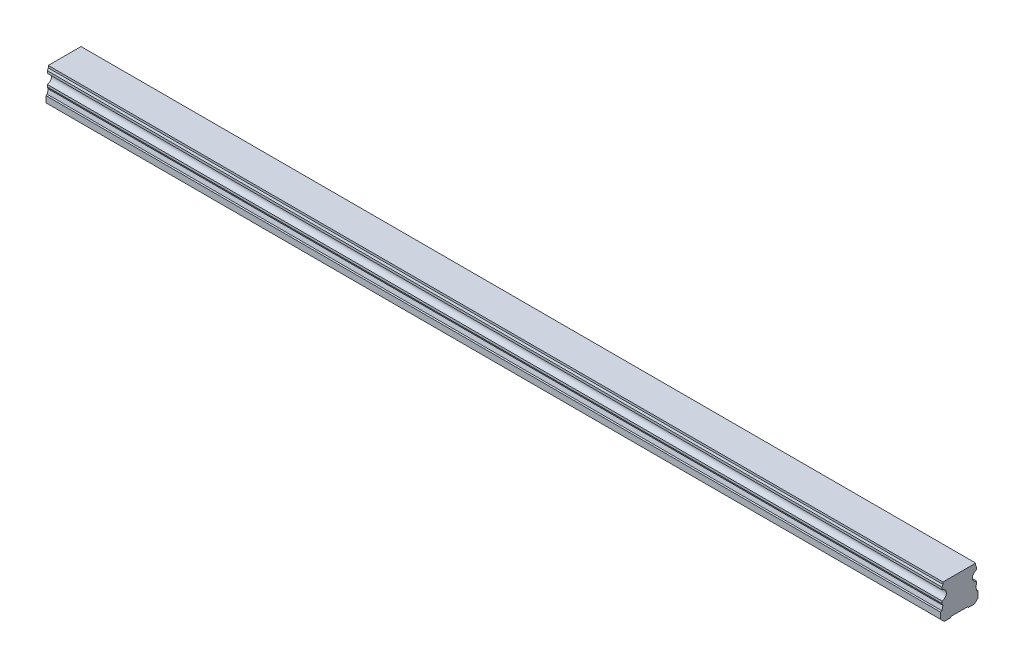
ISO-10303-21;
HEADER;
FILE_DESCRIPTION(('STEP AP214'),'2;1');
FILE_NAME('part.step','',(''),(''),'','','');
FILE_SCHEMA(('AUTOMOTIVE_DESIGN { 1 0 10303 214 1 1 1 1 }'));
ENDSEC;
DATA;
#1=APPLICATION_CONTEXT('core data for automotive mechanical design processes');
#2=APPLICATION_PROTOCOL_DEFINITION('international standard','automotive_design',2000,#1);
#3=PRODUCT_CONTEXT('',#1,'mechanical');
#4=PRODUCT('Part','Part','',(#3));
#5=PRODUCT_RELATED_PRODUCT_CATEGORY('part','',(#4));
#6=PRODUCT_DEFINITION_FORMATION('','',#4);
#7=PRODUCT_DEFINITION_CONTEXT('part definition',#1,'design');
#8=PRODUCT_DEFINITION('design','',#6,#7);
#9=PRODUCT_DEFINITION_SHAPE('','',#8);
#10=(LENGTH_UNIT() NAMED_UNIT(*) SI_UNIT(.MILLI.,.METRE.));
#11=(NAMED_UNIT(*) PLANE_ANGLE_UNIT() SI_UNIT($,.RADIAN.));
#12=(NAMED_UNIT(*) SI_UNIT($,.STERADIAN.) SOLID_ANGLE_UNIT());
#13=UNCERTAINTY_MEASURE_WITH_UNIT(LENGTH_MEASURE(1.E-05),#10,'distance_accuracy_value','');
#14=(GEOMETRIC_REPRESENTATION_CONTEXT(3) GLOBAL_UNCERTAINTY_ASSIGNED_CONTEXT((#13)) GLOBAL_UNIT_ASSIGNED_CONTEXT((#10,
#11,#12)) REPRESENTATION_CONTEXT('',''));
#15=CARTESIAN_POINT('',(0.,0.,0.));
#16=DIRECTION('',(0.,0.,1.));
#17=DIRECTION('',(1.,0.,0.));
#18=AXIS2_PLACEMENT_3D('',#15,#16,#17);
#19=CARTESIAN_POINT('',(330.,0.399999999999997,0.));
#20=DIRECTION('',(0.,-1.,0.));
#21=DIRECTION('',(0.,0.,-1.));
#22=AXIS2_PLACEMENT_3D('',#19,#20,#21);
#23=CONICAL_SURFACE('',#22,2.90000000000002,0.785398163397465);
#24=CARTESIAN_POINT('',(330.,0.799999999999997,0.));
#25=DIRECTION('',(0.,1.,0.));
#26=DIRECTION('',(0.,0.,1.));
#27=AXIS2_PLACEMENT_3D('',#24,#25,#26);
#28=CIRCLE('',#27,2.5);
#29=CARTESIAN_POINT('',(330.,0.799999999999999,2.5));
#30=VERTEX_POINT('',#29);
#31=EDGE_CURVE('E11',#30,#30,#28,.F.);
#32=ORIENTED_EDGE('',*,*,#31,.F.);
#33=EDGE_LOOP('',(#32));
#34=FACE_BOUND('',#33,.T.);
#35=CARTESIAN_POINT('',(330.,0.399999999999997,0.));
#36=DIRECTION('',(0.,1.,0.));
#37=DIRECTION('',(0.,0.,1.));
#38=AXIS2_PLACEMENT_3D('',#35,#36,#37);
#39=CIRCLE('',#38,2.90000000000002);
#40=CARTESIAN_POINT('',(330.,0.399999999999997,2.90000000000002));
#41=VERTEX_POINT('',#40);
#42=EDGE_CURVE('E468',#41,#41,#39,.T.);
#43=ORIENTED_EDGE('',*,*,#42,.F.);
#44=EDGE_LOOP('',(#43));
#45=FACE_BOUND('',#44,.T.);
#46=ADVANCED_FACE('F39',(#34,#45),#23,.F.);
#47=CARTESIAN_POINT('',(330.,7.,0.));
#48=DIRECTION('',(0.,-1.,0.));
#49=DIRECTION('',(0.,0.,-1.));
#50=AXIS2_PLACEMENT_3D('',#47,#48,#49);
#51=CYLINDRICAL_SURFACE('',#50,2.5);
#52=ORIENTED_EDGE('',*,*,#31,.T.);
#53=EDGE_LOOP('',(#52));
#54=FACE_BOUND('',#53,.T.);
#55=CARTESIAN_POINT('',(330.,7.,0.));
#56=DIRECTION('',(0.,-1.,0.));
#57=DIRECTION('',(0.,0.,-1.));
#58=AXIS2_PLACEMENT_3D('',#55,#56,#57);
#59=CIRCLE('',#58,2.5);
#60=CARTESIAN_POINT('',(330.,7.,-2.50000000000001));
#61=VERTEX_POINT('',#60);
#62=EDGE_CURVE('E49',#61,#61,#59,.T.);
#63=ORIENTED_EDGE('',*,*,#62,.F.);
#64=EDGE_LOOP('',(#63));
#65=FACE_BOUND('',#64,.T.);
#66=ADVANCED_FACE('F626',(#54,#65),#51,.F.);
#67=CARTESIAN_POINT('',(330.,7.,0.));
#68=DIRECTION('',(0.,-1.,0.));
#69=DIRECTION('',(0.,0.,-1.));
#70=AXIS2_PLACEMENT_3D('',#67,#68,#69);
#71=PLANE('',#70);
#72=CARTESIAN_POINT('',(330.,7.,0.));
#73=DIRECTION('',(0.,-1.,0.));
#74=DIRECTION('',(0.,0.,-1.));
#75=AXIS2_PLACEMENT_3D('',#72,#73,#74);
#76=CIRCLE('',#75,2.1);
#77=CARTESIAN_POINT('',(330.,7.,-2.1));
#78=VERTEX_POINT('',#77);
#79=EDGE_CURVE('E42',#78,#78,#76,.T.);
#80=ORIENTED_EDGE('',*,*,#79,.F.);
#81=EDGE_LOOP('',(#80));
#82=FACE_BOUND('',#81,.T.);
#83=ORIENTED_EDGE('',*,*,#62,.T.);
#84=EDGE_LOOP('',(#83));
#85=FACE_BOUND('',#84,.T.);
#86=ADVANCED_FACE('F631',(#82,#85),#71,.T.);
#87=CARTESIAN_POINT('',(270.,0.399999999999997,0.));
#88=DIRECTION('',(0.,-1.,0.));
#89=DIRECTION('',(0.,0.,-1.));
#90=AXIS2_PLACEMENT_3D('',#87,#88,#89);
#91=CONICAL_SURFACE('',#90,2.90000000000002,0.785398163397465);
#92=CARTESIAN_POINT('',(270.,0.799999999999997,0.));
#93=DIRECTION('',(0.,1.,0.));
#94=DIRECTION('',(0.,0.,1.));
#95=AXIS2_PLACEMENT_3D('',#92,#93,#94);
#96=CIRCLE('',#95,2.5);
#97=CARTESIAN_POINT('',(270.,0.799999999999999,2.5));
#98=VERTEX_POINT('',#97);
#99=EDGE_CURVE('E464',#98,#98,#96,.F.);
#100=ORIENTED_EDGE('',*,*,#99,.F.);
#101=EDGE_LOOP('',(#100));
#102=FACE_BOUND('',#101,.T.);
#103=CARTESIAN_POINT('',(270.,0.399999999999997,0.));
#104=DIRECTION('',(0.,1.,0.));
#105=DIRECTION('',(0.,0.,1.));
#106=AXIS2_PLACEMENT_3D('',#103,#104,#105);
#107=CIRCLE('',#106,2.90000000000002);
#108=CARTESIAN_POINT('',(270.,0.399999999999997,2.90000000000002));
#109=VERTEX_POINT('',#108);
#110=EDGE_CURVE('E456',#109,#109,#107,.T.);
#111=ORIENTED_EDGE('',*,*,#110,.F.);
#112=EDGE_LOOP('',(#111));
#113=FACE_BOUND('',#112,.T.);
#114=ADVANCED_FACE('F742',(#102,#113),#91,.F.);
#115=CARTESIAN_POINT('',(270.,7.,0.));
#116=DIRECTION('',(0.,-1.,0.));
#117=DIRECTION('',(0.,0.,-1.));
#118=AXIS2_PLACEMENT_3D('',#115,#116,#117);
#119=CYLINDRICAL_SURFACE('',#118,2.5);
#120=ORIENTED_EDGE('',*,*,#99,.T.);
#121=EDGE_LOOP('',(#120));
#122=FACE_BOUND('',#121,.T.);
#123=CARTESIAN_POINT('',(270.,7.,0.));
#124=DIRECTION('',(0.,-1.,0.));
#125=DIRECTION('',(0.,0.,-1.));
#126=AXIS2_PLACEMENT_3D('',#123,#124,#125);
#127=CIRCLE('',#126,2.5);
#128=CARTESIAN_POINT('',(270.,7.,-2.50000000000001));
#129=VERTEX_POINT('',#128);
#130=EDGE_CURVE('E460',#129,#129,#127,.T.);
#131=ORIENTED_EDGE('',*,*,#130,.F.);
#132=EDGE_LOOP('',(#131));
#133=FACE_BOUND('',#132,.T.);
#134=ADVANCED_FACE('F738',(#122,#133),#119,.F.);
#135=CARTESIAN_POINT('',(270.,7.,0.));
#136=DIRECTION('',(0.,-1.,0.));
#137=DIRECTION('',(0.,0.,-1.));
#138=AXIS2_PLACEMENT_3D('',#135,#136,#137);
#139=PLANE('',#138);
#140=CARTESIAN_POINT('',(270.,7.,0.));
#141=DIRECTION('',(0.,-1.,0.));
#142=DIRECTION('',(0.,0.,-1.));
#143=AXIS2_PLACEMENT_3D('',#140,#141,#142);
#144=CIRCLE('',#143,2.1);
#145=CARTESIAN_POINT('',(270.,7.,-2.1));
#146=VERTEX_POINT('',#145);
#147=EDGE_CURVE('E487',#146,#146,#144,.T.);
#148=ORIENTED_EDGE('',*,*,#147,.F.);
#149=EDGE_LOOP('',(#148));
#150=FACE_BOUND('',#149,.T.);
#151=ORIENTED_EDGE('',*,*,#130,.T.);
#152=EDGE_LOOP('',(#151));
#153=FACE_BOUND('',#152,.T.);
#154=ADVANCED_FACE('F734',(#150,#153),#139,.T.);
#155=CARTESIAN_POINT('',(210.,0.399999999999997,0.));
#156=DIRECTION('',(0.,-1.,0.));
#157=DIRECTION('',(0.,0.,-1.));
#158=AXIS2_PLACEMENT_3D('',#155,#156,#157);
#159=CONICAL_SURFACE('',#158,2.90000000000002,0.785398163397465);
#160=CARTESIAN_POINT('',(210.,0.799999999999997,0.));
#161=DIRECTION('',(0.,1.,0.));
#162=DIRECTION('',(0.,0.,1.));
#163=AXIS2_PLACEMENT_3D('',#160,#161,#162);
#164=CIRCLE('',#163,2.5);
#165=CARTESIAN_POINT('',(210.,0.799999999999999,2.5));
#166=VERTEX_POINT('',#165);
#167=EDGE_CURVE('E452',#166,#166,#164,.F.);
#168=ORIENTED_EDGE('',*,*,#167,.F.);
#169=EDGE_LOOP('',(#168));
#170=FACE_BOUND('',#169,.T.);
#171=CARTESIAN_POINT('',(210.,0.399999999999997,0.));
#172=DIRECTION('',(0.,1.,0.));
#173=DIRECTION('',(0.,0.,1.));
#174=AXIS2_PLACEMENT_3D('',#171,#172,#173);
#175=CIRCLE('',#174,2.90000000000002);
#176=CARTESIAN_POINT('',(210.,0.399999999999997,2.90000000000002));
#177=VERTEX_POINT('',#176);
#178=EDGE_CURVE('E444',#177,#177,#175,.T.);
#179=ORIENTED_EDGE('',*,*,#178,.F.);
#180=EDGE_LOOP('',(#179));
#181=FACE_BOUND('',#180,.T.);
#182=ADVANCED_FACE('F730',(#170,#181),#159,.F.);
#183=CARTESIAN_POINT('',(210.,7.,0.));
#184=DIRECTION('',(0.,-1.,0.));
#185=DIRECTION('',(0.,0.,-1.));
#186=AXIS2_PLACEMENT_3D('',#183,#184,#185);
#187=CYLINDRICAL_SURFACE('',#186,2.5);
#188=ORIENTED_EDGE('',*,*,#167,.T.);
#189=EDGE_LOOP('',(#188));
#190=FACE_BOUND('',#189,.T.);
#191=CARTESIAN_POINT('',(210.,7.,0.));
#192=DIRECTION('',(0.,-1.,0.));
#193=DIRECTION('',(0.,0.,-1.));
#194=AXIS2_PLACEMENT_3D('',#191,#192,#193);
#195=CIRCLE('',#194,2.5);
#196=CARTESIAN_POINT('',(210.,7.,-2.50000000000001));
#197=VERTEX_POINT('',#196);
#198=EDGE_CURVE('E448',#197,#197,#195,.T.);
#199=ORIENTED_EDGE('',*,*,#198,.F.);
#200=EDGE_LOOP('',(#199));
#201=FACE_BOUND('',#200,.T.);
#202=ADVANCED_FACE('F726',(#190,#201),#187,.F.);
#203=CARTESIAN_POINT('',(210.,7.,0.));
#204=DIRECTION('',(0.,-1.,0.));
#205=DIRECTION('',(0.,0.,-1.));
#206=AXIS2_PLACEMENT_3D('',#203,#204,#205);
#207=PLANE('',#206);
#208=CARTESIAN_POINT('',(210.,7.,0.));
#209=DIRECTION('',(0.,-1.,0.));
#210=DIRECTION('',(0.,0.,-1.));
#211=AXIS2_PLACEMENT_3D('',#208,#209,#210);
#212=CIRCLE('',#211,2.1);
#213=CARTESIAN_POINT('',(210.,7.,-2.1));
#214=VERTEX_POINT('',#213);
#215=EDGE_CURVE('E484',#214,#214,#212,.T.);
#216=ORIENTED_EDGE('',*,*,#215,.F.);
#217=EDGE_LOOP('',(#216));
#218=FACE_BOUND('',#217,.T.);
#219=ORIENTED_EDGE('',*,*,#198,.T.);
#220=EDGE_LOOP('',(#219));
#221=FACE_BOUND('',#220,.T.);
#222=ADVANCED_FACE('F722',(#218,#221),#207,.T.);
#223=CARTESIAN_POINT('',(150.,0.399999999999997,0.));
#224=DIRECTION('',(0.,-1.,0.));
#225=DIRECTION('',(0.,0.,-1.));
#226=AXIS2_PLACEMENT_3D('',#223,#224,#225);
#227=CONICAL_SURFACE('',#226,2.90000000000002,0.785398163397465);
#228=CARTESIAN_POINT('',(150.,0.799999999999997,0.));
#229=DIRECTION('',(0.,1.,0.));
#230=DIRECTION('',(0.,0.,1.));
#231=AXIS2_PLACEMENT_3D('',#228,#229,#230);
#232=CIRCLE('',#231,2.5);
#233=CARTESIAN_POINT('',(150.,0.799999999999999,2.5));
#234=VERTEX_POINT('',#233);
#235=EDGE_CURVE('E440',#234,#234,#232,.F.);
#236=ORIENTED_EDGE('',*,*,#235,.F.);
#237=EDGE_LOOP('',(#236));
#238=FACE_BOUND('',#237,.T.);
#239=CARTESIAN_POINT('',(150.,0.399999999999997,0.));
#240=DIRECTION('',(0.,1.,0.));
#241=DIRECTION('',(0.,0.,1.));
#242=AXIS2_PLACEMENT_3D('',#239,#240,#241);
#243=CIRCLE('',#242,2.90000000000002);
#244=CARTESIAN_POINT('',(150.,0.399999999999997,2.90000000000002));
#245=VERTEX_POINT('',#244);
#246=EDGE_CURVE('E433',#245,#245,#243,.T.);
#247=ORIENTED_EDGE('',*,*,#246,.F.);
#248=EDGE_LOOP('',(#247));
#249=FACE_BOUND('',#248,.T.);
#250=ADVANCED_FACE('F718',(#238,#249),#227,.F.);
#251=CARTESIAN_POINT('',(150.,7.,0.));
#252=DIRECTION('',(0.,-1.,0.));
#253=DIRECTION('',(0.,0.,-1.));
#254=AXIS2_PLACEMENT_3D('',#251,#252,#253);
#255=CYLINDRICAL_SURFACE('',#254,2.5);
#256=ORIENTED_EDGE('',*,*,#235,.T.);
#257=EDGE_LOOP('',(#256));
#258=FACE_BOUND('',#257,.T.);
#259=CARTESIAN_POINT('',(150.,7.,0.));
#260=DIRECTION('',(0.,-1.,0.));
#261=DIRECTION('',(0.,0.,-1.));
#262=AXIS2_PLACEMENT_3D('',#259,#260,#261);
#263=CIRCLE('',#262,2.5);
#264=CARTESIAN_POINT('',(150.,7.,-2.50000000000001));
#265=VERTEX_POINT('',#264);
#266=EDGE_CURVE('E436',#265,#265,#263,.T.);
#267=ORIENTED_EDGE('',*,*,#266,.F.);
#268=EDGE_LOOP('',(#267));
#269=FACE_BOUND('',#268,.T.);
#270=ADVANCED_FACE('F714',(#258,#269),#255,.F.);
#271=CARTESIAN_POINT('',(150.,7.,0.));
#272=DIRECTION('',(0.,-1.,0.));
#273=DIRECTION('',(0.,0.,-1.));
#274=AXIS2_PLACEMENT_3D('',#271,#272,#273);
#275=PLANE('',#274);
#276=CARTESIAN_POINT('',(150.,7.,0.));
#277=DIRECTION('',(0.,-1.,0.));
#278=DIRECTION('',(0.,0.,-1.));
#279=AXIS2_PLACEMENT_3D('',#276,#277,#278);
#280=CIRCLE('',#279,2.1);
#281=CARTESIAN_POINT('',(150.,7.,-2.1));
#282=VERTEX_POINT('',#281);
#283=EDGE_CURVE('E479',#282,#282,#280,.T.);
#284=ORIENTED_EDGE('',*,*,#283,.F.);
#285=EDGE_LOOP('',(#284));
#286=FACE_BOUND('',#285,.T.);
#287=ORIENTED_EDGE('',*,*,#266,.T.);
#288=EDGE_LOOP('',(#287));
#289=FACE_BOUND('',#288,.T.);
#290=ADVANCED_FACE('F704',(#286,#289),#275,.T.);
#291=CARTESIAN_POINT('',(360.,14.,-6.59000000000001));
#292=DIRECTION('',(0.,0.,1.));
#293=DIRECTION('',(0.,-1.,0.));
#294=AXIS2_PLACEMENT_3D('',#291,#292,#293);
#295=PLANE('',#294);
#296=DIRECTION('',(0.,1.,0.));
#297=VECTOR('',#296,1.);
#298=CARTESIAN_POINT('',(0.,14.,-6.59000000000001));
#299=LINE('',#298,#297);
#300=CARTESIAN_POINT('',(0.,13.15,-6.59));
#301=VERTEX_POINT('',#300);
#302=CARTESIAN_POINT('',(0.,14.,-6.59000000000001));
#303=VERTEX_POINT('',#302);
#304=EDGE_CURVE('E255',#301,#303,#299,.T.);
#305=ORIENTED_EDGE('',*,*,#304,.T.);
#306=DIRECTION('',(-1.,0.,0.));
#307=VECTOR('',#306,1.);
#308=CARTESIAN_POINT('',(360.,14.,-6.59000000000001));
#309=LINE('',#308,#307);
#310=CARTESIAN_POINT('',(360.,14.,-6.59000000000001));
#311=VERTEX_POINT('',#310);
#312=EDGE_CURVE('E422',#311,#303,#309,.T.);
#313=ORIENTED_EDGE('',*,*,#312,.F.);
#314=DIRECTION('',(0.,1.,0.));
#315=VECTOR('',#314,1.);
#316=CARTESIAN_POINT('',(360.,14.,-6.59000000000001));
#317=LINE('',#316,#315);
#318=CARTESIAN_POINT('',(360.,13.15,-6.59));
#319=VERTEX_POINT('',#318);
#320=EDGE_CURVE('E331',#319,#311,#317,.T.);
#321=ORIENTED_EDGE('',*,*,#320,.F.);
#322=DIRECTION('',(-1.,0.,0.));
#323=VECTOR('',#322,1.);
#324=CARTESIAN_POINT('',(360.,13.15,-6.59));
#325=LINE('',#324,#323);
#326=EDGE_CURVE('E251',#319,#301,#325,.T.);
#327=ORIENTED_EDGE('',*,*,#326,.T.);
#328=EDGE_LOOP('',(#305,#313,#321,#327));
#329=FACE_BOUND('',#328,.T.);
#330=ADVANCED_FACE('F701',(#329),#295,.F.);
#331=CARTESIAN_POINT('',(360.,14.,-6.59000000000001));
#332=DIRECTION('',(0.,-1.,0.));
#333=DIRECTION('',(0.,0.,-1.));
#334=AXIS2_PLACEMENT_3D('',#331,#332,#333);
#335=PLANE('',#334);
#336=DIRECTION('',(0.,0.,1.));
#337=VECTOR('',#336,1.);
#338=CARTESIAN_POINT('',(0.,14.,-6.59000000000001));
#339=LINE('',#338,#337);
#340=CARTESIAN_POINT('',(0.,14.,6.59));
#341=VERTEX_POINT('',#340);
#342=EDGE_CURVE('E259',#303,#341,#339,.T.);
#343=ORIENTED_EDGE('',*,*,#342,.T.);
#344=DIRECTION('',(-1.,0.,0.));
#345=VECTOR('',#344,1.);
#346=CARTESIAN_POINT('',(360.,14.,6.59));
#347=LINE('',#346,#345);
#348=CARTESIAN_POINT('',(360.,14.,6.59));
#349=VERTEX_POINT('',#348);
#350=EDGE_CURVE('E418',#349,#341,#347,.T.);
#351=ORIENTED_EDGE('',*,*,#350,.F.);
#352=DIRECTION('',(0.,0.,1.));
#353=VECTOR('',#352,1.);
#354=CARTESIAN_POINT('',(360.,14.,-6.59000000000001));
#355=LINE('',#354,#353);
#356=EDGE_CURVE('E157',#311,#349,#355,.T.);
#357=ORIENTED_EDGE('',*,*,#356,.F.);
#358=ORIENTED_EDGE('',*,*,#312,.T.);
#359=EDGE_LOOP('',(#343,#351,#357,#358));
#360=FACE_BOUND('',#359,.T.);
#361=ADVANCED_FACE('F697',(#360),#335,.F.);
#362=CARTESIAN_POINT('',(360.,14.,6.59));
#363=DIRECTION('',(0.,0.,-1.));
#364=DIRECTION('',(0.,1.,0.));
#365=AXIS2_PLACEMENT_3D('',#362,#363,#364);
#366=PLANE('',#365);
#367=DIRECTION('',(0.,-1.,0.));
#368=VECTOR('',#367,1.);
#369=CARTESIAN_POINT('',(0.,14.,6.59));
#370=LINE('',#369,#368);
#371=CARTESIAN_POINT('',(0.,13.15,6.59));
#372=VERTEX_POINT('',#371);
#373=EDGE_CURVE('E263',#341,#372,#370,.T.);
#374=ORIENTED_EDGE('',*,*,#373,.T.);
#375=DIRECTION('',(-1.,0.,0.));
#376=VECTOR('',#375,1.);
#377=CARTESIAN_POINT('',(360.,13.15,6.59));
#378=LINE('',#377,#376);
#379=CARTESIAN_POINT('',(360.,13.15,6.59));
#380=VERTEX_POINT('',#379);
#381=EDGE_CURVE('E414',#380,#372,#378,.T.);
#382=ORIENTED_EDGE('',*,*,#381,.F.);
#383=DIRECTION('',(0.,-1.,0.));
#384=VECTOR('',#383,1.);
#385=CARTESIAN_POINT('',(360.,14.,6.59));
#386=LINE('',#385,#384);
#387=EDGE_CURVE('E529',#349,#380,#386,.T.);
#388=ORIENTED_EDGE('',*,*,#387,.F.);
#389=ORIENTED_EDGE('',*,*,#350,.T.);
#390=EDGE_LOOP('',(#374,#382,#388,#389));
#391=FACE_BOUND('',#390,.T.);
#392=ADVANCED_FACE('F693',(#391),#366,.F.);
#393=CARTESIAN_POINT('',(360.,13.15,6.59));
#394=DIRECTION('',(0.,-0.422618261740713,-0.906307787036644));
#395=DIRECTION('',(0.,0.906307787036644,-0.422618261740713));
#396=AXIS2_PLACEMENT_3D('',#393,#394,#395);
#397=PLANE('',#396);
#398=DIRECTION('',(0.,-0.906307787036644,0.422618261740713));
#399=VECTOR('',#398,1.);
#400=CARTESIAN_POINT('',(0.,13.15,6.59));
#401=LINE('',#400,#399);
#402=CARTESIAN_POINT('',(0.,12.3565324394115,6.96));
#403=VERTEX_POINT('',#402);
#404=EDGE_CURVE('E266',#372,#403,#401,.T.);
#405=ORIENTED_EDGE('',*,*,#404,.T.);
#406=DIRECTION('',(-1.,0.,0.));
#407=VECTOR('',#406,1.);
#408=CARTESIAN_POINT('',(360.,12.3565324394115,6.96));
#409=LINE('',#408,#407);
#410=CARTESIAN_POINT('',(360.,12.3565324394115,6.96));
#411=VERTEX_POINT('',#410);
#412=EDGE_CURVE('E410',#411,#403,#409,.T.);
#413=ORIENTED_EDGE('',*,*,#412,.F.);
#414=DIRECTION('',(0.,-0.906307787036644,0.422618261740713));
#415=VECTOR('',#414,1.);
#416=CARTESIAN_POINT('',(360.,13.15,6.59));
#417=LINE('',#416,#415);
#418=EDGE_CURVE('E532',#380,#411,#417,.T.);
#419=ORIENTED_EDGE('',*,*,#418,.F.);
#420=ORIENTED_EDGE('',*,*,#381,.T.);
#421=EDGE_LOOP('',(#405,#413,#419,#420));
#422=FACE_BOUND('',#421,.T.);
#423=ADVANCED_FACE('F689',(#422),#397,.F.);
#424=CARTESIAN_POINT('',(360.,12.3565324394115,6.96));
#425=DIRECTION('',(0.,0.,-1.));
#426=DIRECTION('',(0.,1.,0.));
#427=AXIS2_PLACEMENT_3D('',#424,#425,#426);
#428=PLANE('',#427);
#429=DIRECTION('',(0.,-1.,0.));
#430=VECTOR('',#429,1.);
#431=CARTESIAN_POINT('',(0.,12.3565324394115,6.96));
#432=LINE('',#431,#430);
#433=CARTESIAN_POINT('',(0.,11.4351744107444,6.96));
#434=VERTEX_POINT('',#433);
#435=EDGE_CURVE('E269',#403,#434,#432,.T.);
#436=ORIENTED_EDGE('',*,*,#435,.T.);
#437=DIRECTION('',(-1.,0.,0.));
#438=VECTOR('',#437,1.);
#439=CARTESIAN_POINT('',(360.,11.4351744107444,6.96));
#440=LINE('',#439,#438);
#441=CARTESIAN_POINT('',(360.,11.4351744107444,6.96));
#442=VERTEX_POINT('',#441);
#443=EDGE_CURVE('E406',#442,#434,#440,.T.);
#444=ORIENTED_EDGE('',*,*,#443,.F.);
#445=DIRECTION('',(0.,-1.,0.));
#446=VECTOR('',#445,1.);
#447=CARTESIAN_POINT('',(360.,12.3565324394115,6.96));
#448=LINE('',#447,#446);
#449=EDGE_CURVE('E535',#411,#442,#448,.T.);
#450=ORIENTED_EDGE('',*,*,#449,.F.);
#451=ORIENTED_EDGE('',*,*,#412,.T.);
#452=EDGE_LOOP('',(#436,#444,#450,#451));
#453=FACE_BOUND('',#452,.T.);
#454=ADVANCED_FACE('F685',(#453),#428,.F.);
#455=CARTESIAN_POINT('',(360.,9.5,7.2));
#456=DIRECTION('',(-1.,0.,0.));
#457=DIRECTION('',(0.,0.,1.));
#458=AXIS2_PLACEMENT_3D('',#455,#456,#457);
#459=CYLINDRICAL_SURFACE('',#458,1.95);
#460=CARTESIAN_POINT('',(0.,9.5,7.2));
#461=DIRECTION('',(-1.,0.,0.));
#462=DIRECTION('',(0.,0.,-1.));
#463=AXIS2_PLACEMENT_3D('',#460,#461,#462);
#464=CIRCLE('',#463,1.95);
#465=CARTESIAN_POINT('',(0.,7.56482558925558,6.96));
#466=VERTEX_POINT('',#465);
#467=EDGE_CURVE('E272',#434,#466,#464,.T.);
#468=ORIENTED_EDGE('',*,*,#467,.T.);
#469=DIRECTION('',(-1.,0.,0.));
#470=VECTOR('',#469,1.);
#471=CARTESIAN_POINT('',(360.,7.56482558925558,6.96));
#472=LINE('',#471,#470);
#473=CARTESIAN_POINT('',(360.,7.56482558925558,6.96));
#474=VERTEX_POINT('',#473);
#475=EDGE_CURVE('E402',#474,#466,#472,.T.);
#476=ORIENTED_EDGE('',*,*,#475,.F.);
#477=CARTESIAN_POINT('',(360.,9.5,7.2));
#478=DIRECTION('',(-1.,0.,0.));
#479=DIRECTION('',(0.,0.,-1.));
#480=AXIS2_PLACEMENT_3D('',#477,#478,#479);
#481=CIRCLE('',#480,1.95);
#482=EDGE_CURVE('E538',#442,#474,#481,.T.);
#483=ORIENTED_EDGE('',*,*,#482,.F.);
#484=ORIENTED_EDGE('',*,*,#443,.T.);
#485=EDGE_LOOP('',(#468,#476,#483,#484));
#486=FACE_BOUND('',#485,.T.);
#487=ADVANCED_FACE('F681',(#486),#459,.F.);
#488=CARTESIAN_POINT('',(360.,7.56482558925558,6.96));
#489=DIRECTION('',(0.,0.,-1.));
#490=DIRECTION('',(0.,1.,0.));
#491=AXIS2_PLACEMENT_3D('',#488,#489,#490);
#492=PLANE('',#491);
#493=DIRECTION('',(0.,-1.,0.));
#494=VECTOR('',#493,1.);
#495=CARTESIAN_POINT('',(0.,7.56482558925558,6.96));
#496=LINE('',#495,#494);
#497=CARTESIAN_POINT('',(0.,6.64346756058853,6.96));
#498=VERTEX_POINT('',#497);
#499=EDGE_CURVE('E275',#466,#498,#496,.T.);
#500=ORIENTED_EDGE('',*,*,#499,.T.);
#501=DIRECTION('',(-1.,0.,0.));
#502=VECTOR('',#501,1.);
#503=CARTESIAN_POINT('',(360.,6.64346756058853,6.96));
#504=LINE('',#503,#502);
#505=CARTESIAN_POINT('',(360.,6.64346756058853,6.96));
#506=VERTEX_POINT('',#505);
#507=EDGE_CURVE('E398',#506,#498,#504,.T.);
#508=ORIENTED_EDGE('',*,*,#507,.F.);
#509=DIRECTION('',(0.,-1.,0.));
#510=VECTOR('',#509,1.);
#511=CARTESIAN_POINT('',(360.,7.56482558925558,6.96));
#512=LINE('',#511,#510);
#513=EDGE_CURVE('E541',#474,#506,#512,.T.);
#514=ORIENTED_EDGE('',*,*,#513,.F.);
#515=ORIENTED_EDGE('',*,*,#475,.T.);
#516=EDGE_LOOP('',(#500,#508,#514,#515));
#517=FACE_BOUND('',#516,.T.);
#518=ADVANCED_FACE('F677',(#517),#492,.F.);
#519=CARTESIAN_POINT('',(360.,6.64346756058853,6.96));
#520=DIRECTION('',(0.,0.422618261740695,-0.906307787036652));
#521=DIRECTION('',(0.,0.906307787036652,0.422618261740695));
#522=AXIS2_PLACEMENT_3D('',#519,#520,#521);
#523=PLANE('',#522);
#524=DIRECTION('',(0.,-0.906307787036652,-0.422618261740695));
#525=VECTOR('',#524,1.);
#526=CARTESIAN_POINT('',(0.,6.64346756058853,6.96));
#527=LINE('',#526,#525);
#528=CARTESIAN_POINT('',(0.,5.85,6.59000000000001));
#529=VERTEX_POINT('',#528);
#530=EDGE_CURVE('E278',#498,#529,#527,.T.);
#531=ORIENTED_EDGE('',*,*,#530,.T.);
#532=DIRECTION('',(-1.,0.,0.));
#533=VECTOR('',#532,1.);
#534=CARTESIAN_POINT('',(360.,5.85,6.59000000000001));
#535=LINE('',#534,#533);
#536=CARTESIAN_POINT('',(360.,5.85,6.59000000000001));
#537=VERTEX_POINT('',#536);
#538=EDGE_CURVE('E394',#537,#529,#535,.T.);
#539=ORIENTED_EDGE('',*,*,#538,.F.);
#540=DIRECTION('',(0.,-0.906307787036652,-0.422618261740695));
#541=VECTOR('',#540,1.);
#542=CARTESIAN_POINT('',(360.,6.64346756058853,6.96));
#543=LINE('',#542,#541);
#544=EDGE_CURVE('E544',#506,#537,#543,.T.);
#545=ORIENTED_EDGE('',*,*,#544,.F.);
#546=ORIENTED_EDGE('',*,*,#507,.T.);
#547=EDGE_LOOP('',(#531,#539,#545,#546));
#548=FACE_BOUND('',#547,.T.);
#549=ADVANCED_FACE('F673',(#548),#523,.F.);
#550=CARTESIAN_POINT('',(360.,5.85,6.59000000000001));
#551=DIRECTION('',(0.,-0.25881904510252,-0.965925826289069));
#552=DIRECTION('',(0.,0.965925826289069,-0.25881904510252));
#553=AXIS2_PLACEMENT_3D('',#550,#551,#552);
#554=PLANE('',#553);
#555=DIRECTION('',(0.,-0.965925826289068,0.25881904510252));
#556=VECTOR('',#555,1.);
#557=CARTESIAN_POINT('',(0.,5.85,6.59000000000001));
#558=LINE('',#557,#556);
#559=CARTESIAN_POINT('',(0.,4.2,7.03211616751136));
#560=VERTEX_POINT('',#559);
#561=EDGE_CURVE('E281',#529,#560,#558,.T.);
#562=ORIENTED_EDGE('',*,*,#561,.T.);
#563=DIRECTION('',(-1.,0.,0.));
#564=VECTOR('',#563,1.);
#565=CARTESIAN_POINT('',(360.,4.2,7.03211616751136));
#566=LINE('',#565,#564);
#567=CARTESIAN_POINT('',(360.,4.2,7.03211616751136));
#568=VERTEX_POINT('',#567);
#569=EDGE_CURVE('E390',#568,#560,#566,.T.);
#570=ORIENTED_EDGE('',*,*,#569,.F.);
#571=DIRECTION('',(0.,-0.965925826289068,0.25881904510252));
#572=VECTOR('',#571,1.);
#573=CARTESIAN_POINT('',(360.,5.85,6.59000000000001));
#574=LINE('',#573,#572);
#575=EDGE_CURVE('E547',#537,#568,#574,.T.);
#576=ORIENTED_EDGE('',*,*,#575,.F.);
#577=ORIENTED_EDGE('',*,*,#538,.T.);
#578=EDGE_LOOP('',(#562,#570,#576,#577));
#579=FACE_BOUND('',#578,.T.);
#580=ADVANCED_FACE('F669',(#579),#554,.F.);
#581=CARTESIAN_POINT('',(360.,4.2,7.03211616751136));
#582=DIRECTION('',(0.,-0.866025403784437,-0.500000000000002));
#583=DIRECTION('',(0.,0.500000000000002,-0.866025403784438));
#584=AXIS2_PLACEMENT_3D('',#581,#582,#583);
#585=PLANE('',#584);
#586=DIRECTION('',(0.,-0.500000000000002,0.866025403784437));
#587=VECTOR('',#586,1.);
#588=CARTESIAN_POINT('',(0.,4.2,7.03211616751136));
#589=LINE('',#588,#587);
#590=CARTESIAN_POINT('',(0.,3.92986714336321,7.5));
#591=VERTEX_POINT('',#590);
#592=EDGE_CURVE('E284',#560,#591,#589,.T.);
#593=ORIENTED_EDGE('',*,*,#592,.T.);
#594=DIRECTION('',(-1.,0.,0.));
#595=VECTOR('',#594,1.);
#596=CARTESIAN_POINT('',(360.,3.92986714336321,7.5));
#597=LINE('',#596,#595);
#598=CARTESIAN_POINT('',(360.,3.92986714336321,7.5));
#599=VERTEX_POINT('',#598);
#600=EDGE_CURVE('E386',#599,#591,#597,.T.);
#601=ORIENTED_EDGE('',*,*,#600,.F.);
#602=DIRECTION('',(0.,-0.500000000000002,0.866025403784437));
#603=VECTOR('',#602,1.);
#604=CARTESIAN_POINT('',(360.,4.2,7.03211616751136));
#605=LINE('',#604,#603);
#606=EDGE_CURVE('E550',#568,#599,#605,.T.);
#607=ORIENTED_EDGE('',*,*,#606,.F.);
#608=ORIENTED_EDGE('',*,*,#569,.T.);
#609=EDGE_LOOP('',(#593,#601,#607,#608));
#610=FACE_BOUND('',#609,.T.);
#611=ADVANCED_FACE('F665',(#610),#585,.F.);
#612=CARTESIAN_POINT('',(360.,3.92986714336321,7.5));
#613=DIRECTION('',(0.,0.,-1.));
#614=DIRECTION('',(0.,1.,0.));
#615=AXIS2_PLACEMENT_3D('',#612,#613,#614);
#616=PLANE('',#615);
#617=DIRECTION('',(0.,-1.,0.));
#618=VECTOR('',#617,1.);
#619=CARTESIAN_POINT('',(0.,3.92986714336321,7.5));
#620=LINE('',#619,#618);
#621=CARTESIAN_POINT('',(0.,1.4,7.5));
#622=VERTEX_POINT('',#621);
#623=EDGE_CURVE('E287',#591,#622,#620,.T.);
#624=ORIENTED_EDGE('',*,*,#623,.T.);
#625=DIRECTION('',(-1.,0.,0.));
#626=VECTOR('',#625,1.);
#627=CARTESIAN_POINT('',(360.,1.4,7.5));
#628=LINE('',#627,#626);
#629=CARTESIAN_POINT('',(360.,1.4,7.5));
#630=VERTEX_POINT('',#629);
#631=EDGE_CURVE('E382',#630,#622,#628,.T.);
#632=ORIENTED_EDGE('',*,*,#631,.F.);
#633=DIRECTION('',(0.,-1.,0.));
#634=VECTOR('',#633,1.);
#635=CARTESIAN_POINT('',(360.,3.92986714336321,7.5));
#636=LINE('',#635,#634);
#637=EDGE_CURVE('E553',#599,#630,#636,.T.);
#638=ORIENTED_EDGE('',*,*,#637,.F.);
#639=ORIENTED_EDGE('',*,*,#600,.T.);
#640=EDGE_LOOP('',(#624,#632,#638,#639));
#641=FACE_BOUND('',#640,.T.);
#642=ADVANCED_FACE('F661',(#641),#616,.F.);
#643=CARTESIAN_POINT('',(360.,1.4,7.5));
#644=DIRECTION('',(0.,0.707106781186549,-0.707106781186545));
#645=DIRECTION('',(0.,0.707106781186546,0.70710678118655));
#646=AXIS2_PLACEMENT_3D('',#643,#644,#645);
#647=PLANE('',#646);
#648=DIRECTION('',(0.,-0.707106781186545,-0.70710678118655));
#649=VECTOR('',#648,1.);
#650=CARTESIAN_POINT('',(0.,1.4,7.5));
#651=LINE('',#650,#649);
#652=CARTESIAN_POINT('',(0.,0.,6.1));
#653=VERTEX_POINT('',#652);
#654=EDGE_CURVE('E290',#622,#653,#651,.T.);
#655=ORIENTED_EDGE('',*,*,#654,.T.);
#656=DIRECTION('',(-1.,0.,0.));
#657=VECTOR('',#656,1.);
#658=CARTESIAN_POINT('',(360.,0.,6.1));
#659=LINE('',#658,#657);
#660=CARTESIAN_POINT('',(360.,0.,6.1));
#661=VERTEX_POINT('',#660);
#662=EDGE_CURVE('E378',#661,#653,#659,.T.);
#663=ORIENTED_EDGE('',*,*,#662,.F.);
#664=DIRECTION('',(0.,-0.707106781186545,-0.70710678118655));
#665=VECTOR('',#664,1.);
#666=CARTESIAN_POINT('',(360.,1.4,7.5));
#667=LINE('',#666,#665);
#668=EDGE_CURVE('E556',#630,#661,#667,.T.);
#669=ORIENTED_EDGE('',*,*,#668,.F.);
#670=ORIENTED_EDGE('',*,*,#631,.T.);
#671=EDGE_LOOP('',(#655,#663,#669,#670));
#672=FACE_BOUND('',#671,.T.);
#673=ADVANCED_FACE('F657',(#672),#647,.F.);
#674=CARTESIAN_POINT('',(360.,0.,6.1));
#675=DIRECTION('',(0.,1.,0.));
#676=DIRECTION('',(0.,0.,1.));
#677=AXIS2_PLACEMENT_3D('',#674,#675,#676);
#678=PLANE('',#677);
#679=DIRECTION('',(0.,0.,-1.));
#680=VECTOR('',#679,1.);
#681=CARTESIAN_POINT('',(0.,0.,6.1));
#682=LINE('',#681,#680);
#683=CARTESIAN_POINT('',(0.,0.,3.65));
#684=VERTEX_POINT('',#683);
#685=EDGE_CURVE('E293',#653,#684,#682,.T.);
#686=ORIENTED_EDGE('',*,*,#685,.T.);
#687=DIRECTION('',(-1.,0.,0.));
#688=VECTOR('',#687,1.);
#689=CARTESIAN_POINT('',(360.,0.,3.65));
#690=LINE('',#689,#688);
#691=CARTESIAN_POINT('',(360.,0.,3.65));
#692=VERTEX_POINT('',#691);
#693=EDGE_CURVE('E374',#692,#684,#690,.T.);
#694=ORIENTED_EDGE('',*,*,#693,.F.);
#695=DIRECTION('',(0.,0.,-1.));
#696=VECTOR('',#695,1.);
#697=CARTESIAN_POINT('',(360.,0.,6.1));
#698=LINE('',#697,#696);
#699=EDGE_CURVE('E559',#661,#692,#698,.T.);
#700=ORIENTED_EDGE('',*,*,#699,.F.);
#701=ORIENTED_EDGE('',*,*,#662,.T.);
#702=EDGE_LOOP('',(#686,#694,#700,#701));
#703=FACE_BOUND('',#702,.T.);
#704=ADVANCED_FACE('F649',(#703),#678,.F.);
#705=CARTESIAN_POINT('',(360.,0.,3.65));
#706=DIRECTION('',(0.,0.707106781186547,0.707106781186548));
#707=DIRECTION('',(0.,-0.707106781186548,0.707106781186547));
#708=AXIS2_PLACEMENT_3D('',#705,#706,#707);
#709=PLANE('',#708);
#710=DIRECTION('',(0.,0.707106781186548,-0.707106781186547));
#711=VECTOR('',#710,1.);
#712=CARTESIAN_POINT('',(0.,0.,3.65));
#713=LINE('',#712,#711);
#714=CARTESIAN_POINT('',(0.,0.399999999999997,3.25));
#715=VERTEX_POINT('',#714);
#716=EDGE_CURVE('E296',#684,#715,#713,.T.);
#717=ORIENTED_EDGE('',*,*,#716,.T.);
#718=DIRECTION('',(-1.,0.,0.));
#719=VECTOR('',#718,1.);
#720=CARTESIAN_POINT('',(360.,0.399999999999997,3.25));
#721=LINE('',#720,#719);
#722=CARTESIAN_POINT('',(360.,0.399999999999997,3.25));
#723=VERTEX_POINT('',#722);
#724=EDGE_CURVE('E370',#723,#715,#721,.T.);
#725=ORIENTED_EDGE('',*,*,#724,.F.);
#726=DIRECTION('',(0.,0.707106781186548,-0.707106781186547));
#727=VECTOR('',#726,1.);
#728=CARTESIAN_POINT('',(360.,0.,3.65));
#729=LINE('',#728,#727);
#730=EDGE_CURVE('E562',#692,#723,#729,.T.);
#731=ORIENTED_EDGE('',*,*,#730,.F.);
#732=ORIENTED_EDGE('',*,*,#693,.T.);
#733=EDGE_LOOP('',(#717,#725,#731,#732));
#734=FACE_BOUND('',#733,.T.);
#735=ADVANCED_FACE('F640',(#734),#709,.F.);
#736=CARTESIAN_POINT('',(360.,0.399999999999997,3.25));
#737=DIRECTION('',(0.,1.,0.));
#738=DIRECTION('',(0.,0.,1.));
#739=AXIS2_PLACEMENT_3D('',#736,#737,#738);
#740=PLANE('',#739);
#741=CARTESIAN_POINT('',(90.,0.399999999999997,0.));
#742=DIRECTION('',(0.,1.,0.));
#743=DIRECTION('',(0.,0.,1.));
#744=AXIS2_PLACEMENT_3D('',#741,#742,#743);
#745=CIRCLE('',#744,2.90000000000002);
#746=CARTESIAN_POINT('',(90.,0.399999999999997,2.90000000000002));
#747=VERTEX_POINT('',#746);
#748=EDGE_CURVE('E495',#747,#747,#745,.T.);
#749=ORIENTED_EDGE('',*,*,#748,.T.);
#750=EDGE_LOOP('',(#749));
#751=FACE_BOUND('',#750,.T.);
#752=CARTESIAN_POINT('',(30.,0.399999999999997,0.));
#753=DIRECTION('',(0.,1.,0.));
#754=DIRECTION('',(0.,0.,1.));
#755=AXIS2_PLACEMENT_3D('',#752,#753,#754);
#756=CIRCLE('',#755,2.90000000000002);
#757=CARTESIAN_POINT('',(30.,0.399999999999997,2.90000000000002));
#758=VERTEX_POINT('',#757);
#759=EDGE_CURVE('E425',#758,#758,#756,.T.);
#760=ORIENTED_EDGE('',*,*,#759,.T.);
#761=EDGE_LOOP('',(#760));
#762=FACE_BOUND('',#761,.T.);
#763=DIRECTION('',(0.,0.,-1.));
#764=VECTOR('',#763,1.);
#765=CARTESIAN_POINT('',(0.,0.399999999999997,3.25));
#766=LINE('',#765,#764);
#767=CARTESIAN_POINT('',(0.,0.399999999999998,-3.25));
#768=VERTEX_POINT('',#767);
#769=EDGE_CURVE('E299',#715,#768,#766,.T.);
#770=ORIENTED_EDGE('',*,*,#769,.T.);
#771=DIRECTION('',(-1.,0.,0.));
#772=VECTOR('',#771,1.);
#773=CARTESIAN_POINT('',(360.,0.399999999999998,-3.25));
#774=LINE('',#773,#772);
#775=CARTESIAN_POINT('',(360.,0.399999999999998,-3.25));
#776=VERTEX_POINT('',#775);
#777=EDGE_CURVE('E366',#776,#768,#774,.T.);
#778=ORIENTED_EDGE('',*,*,#777,.F.);
#779=DIRECTION('',(0.,0.,-1.));
#780=VECTOR('',#779,1.);
#781=CARTESIAN_POINT('',(360.,0.399999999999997,3.25));
#782=LINE('',#781,#780);
#783=EDGE_CURVE('E565',#723,#776,#782,.T.);
#784=ORIENTED_EDGE('',*,*,#783,.F.);
#785=ORIENTED_EDGE('',*,*,#724,.T.);
#786=EDGE_LOOP('',(#770,#778,#784,#785));
#787=FACE_BOUND('',#786,.T.);
#788=ORIENTED_EDGE('',*,*,#246,.T.);
#789=EDGE_LOOP('',(#788));
#790=FACE_BOUND('',#789,.T.);
#791=ORIENTED_EDGE('',*,*,#178,.T.);
#792=EDGE_LOOP('',(#791));
#793=FACE_BOUND('',#792,.T.);
#794=ORIENTED_EDGE('',*,*,#110,.T.);
#795=EDGE_LOOP('',(#794));
#796=FACE_BOUND('',#795,.T.);
#797=ORIENTED_EDGE('',*,*,#42,.T.);
#798=EDGE_LOOP('',(#797));
#799=FACE_BOUND('',#798,.T.);
#800=ADVANCED_FACE('F637',(#751,#762,#787,#790,#793,#796,#799),#740,.F.);
#801=CARTESIAN_POINT('',(360.,0.399999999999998,-3.25));
#802=DIRECTION('',(0.,0.707106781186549,-0.707106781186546));
#803=DIRECTION('',(0.,0.707106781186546,0.707106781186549));
#804=AXIS2_PLACEMENT_3D('',#801,#802,#803);
#805=PLANE('',#804);
#806=DIRECTION('',(0.,-0.707106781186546,-0.707106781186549));
#807=VECTOR('',#806,1.);
#808=CARTESIAN_POINT('',(0.,0.399999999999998,-3.25));
#809=LINE('',#808,#807);
#810=CARTESIAN_POINT('',(0.,0.,-3.65));
#811=VERTEX_POINT('',#810);
#812=EDGE_CURVE('E302',#768,#811,#809,.T.);
#813=ORIENTED_EDGE('',*,*,#812,.T.);
#814=DIRECTION('',(-1.,0.,0.));
#815=VECTOR('',#814,1.);
#816=CARTESIAN_POINT('',(360.,0.,-3.65));
#817=LINE('',#816,#815);
#818=CARTESIAN_POINT('',(360.,0.,-3.65));
#819=VERTEX_POINT('',#818);
#820=EDGE_CURVE('E362',#819,#811,#817,.T.);
#821=ORIENTED_EDGE('',*,*,#820,.F.);
#822=DIRECTION('',(0.,-0.707106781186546,-0.707106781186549));
#823=VECTOR('',#822,1.);
#824=CARTESIAN_POINT('',(360.,0.399999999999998,-3.25));
#825=LINE('',#824,#823);
#826=EDGE_CURVE('E568',#776,#819,#825,.T.);
#827=ORIENTED_EDGE('',*,*,#826,.F.);
#828=ORIENTED_EDGE('',*,*,#777,.T.);
#829=EDGE_LOOP('',(#813,#821,#827,#828));
#830=FACE_BOUND('',#829,.T.);
#831=ADVANCED_FACE('F639',(#830),#805,.F.);
#832=CARTESIAN_POINT('',(360.,0.,-3.65));
#833=DIRECTION('',(0.,1.,0.));
#834=DIRECTION('',(0.,0.,1.));
#835=AXIS2_PLACEMENT_3D('',#832,#833,#834);
#836=PLANE('',#835);
#837=DIRECTION('',(0.,0.,-1.));
#838=VECTOR('',#837,1.);
#839=CARTESIAN_POINT('',(0.,0.,-3.65));
#840=LINE('',#839,#838);
#841=CARTESIAN_POINT('',(0.,0.,-6.1));
#842=VERTEX_POINT('',#841);
#843=EDGE_CURVE('E304',#811,#842,#840,.T.);
#844=ORIENTED_EDGE('',*,*,#843,.T.);
#845=DIRECTION('',(-1.,0.,0.));
#846=VECTOR('',#845,1.);
#847=CARTESIAN_POINT('',(360.,0.,-6.1));
#848=LINE('',#847,#846);
#849=CARTESIAN_POINT('',(360.,0.,-6.1));
#850=VERTEX_POINT('',#849);
#851=EDGE_CURVE('E358',#850,#842,#848,.T.);
#852=ORIENTED_EDGE('',*,*,#851,.F.);
#853=DIRECTION('',(0.,0.,-1.));
#854=VECTOR('',#853,1.);
#855=CARTESIAN_POINT('',(360.,0.,-3.65));
#856=LINE('',#855,#854);
#857=EDGE_CURVE('E571',#819,#850,#856,.T.);
#858=ORIENTED_EDGE('',*,*,#857,.F.);
#859=ORIENTED_EDGE('',*,*,#820,.T.);
#860=EDGE_LOOP('',(#844,#852,#858,#859));
#861=FACE_BOUND('',#860,.T.);
#862=ADVANCED_FACE('F646',(#861),#836,.F.);
#863=CARTESIAN_POINT('',(360.,0.,-6.1));
#864=DIRECTION('',(0.,0.707106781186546,0.707106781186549));
#865=DIRECTION('',(0.,-0.707106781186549,0.707106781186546));
#866=AXIS2_PLACEMENT_3D('',#863,#864,#865);
#867=PLANE('',#866);
#868=DIRECTION('',(0.,0.707106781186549,-0.707106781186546));
#869=VECTOR('',#868,1.);
#870=CARTESIAN_POINT('',(0.,0.,-6.1));
#871=LINE('',#870,#869);
#872=CARTESIAN_POINT('',(0.,1.4,-7.5));
#873=VERTEX_POINT('',#872);
#874=EDGE_CURVE('E307',#842,#873,#871,.T.);
#875=ORIENTED_EDGE('',*,*,#874,.T.);
#876=DIRECTION('',(-1.,0.,0.));
#877=VECTOR('',#876,1.);
#878=CARTESIAN_POINT('',(360.,1.4,-7.5));
#879=LINE('',#878,#877);
#880=CARTESIAN_POINT('',(360.,1.4,-7.5));
#881=VERTEX_POINT('',#880);
#882=EDGE_CURVE('E354',#881,#873,#879,.T.);
#883=ORIENTED_EDGE('',*,*,#882,.F.);
#884=DIRECTION('',(0.,0.707106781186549,-0.707106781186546));
#885=VECTOR('',#884,1.);
#886=CARTESIAN_POINT('',(360.,0.,-6.1));
#887=LINE('',#886,#885);
#888=EDGE_CURVE('E574',#850,#881,#887,.T.);
#889=ORIENTED_EDGE('',*,*,#888,.F.);
#890=ORIENTED_EDGE('',*,*,#851,.T.);
#891=EDGE_LOOP('',(#875,#883,#889,#890));
#892=FACE_BOUND('',#891,.T.);
#893=ADVANCED_FACE('F841',(#892),#867,.F.);
#894=CARTESIAN_POINT('',(360.,1.4,-7.5));
#895=DIRECTION('',(0.,0.,1.));
#896=DIRECTION('',(0.,-1.,0.));
#897=AXIS2_PLACEMENT_3D('',#894,#895,#896);
#898=PLANE('',#897);
#899=DIRECTION('',(0.,1.,0.));
#900=VECTOR('',#899,1.);
#901=CARTESIAN_POINT('',(0.,1.4,-7.5));
#902=LINE('',#901,#900);
#903=CARTESIAN_POINT('',(0.,3.92986714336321,-7.5));
#904=VERTEX_POINT('',#903);
#905=EDGE_CURVE('E310',#873,#904,#902,.T.);
#906=ORIENTED_EDGE('',*,*,#905,.T.);
#907=DIRECTION('',(-1.,0.,0.));
#908=VECTOR('',#907,1.);
#909=CARTESIAN_POINT('',(360.,3.92986714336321,-7.5));
#910=LINE('',#909,#908);
#911=CARTESIAN_POINT('',(360.,3.92986714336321,-7.5));
#912=VERTEX_POINT('',#911);
#913=EDGE_CURVE('E350',#912,#904,#910,.T.);
#914=ORIENTED_EDGE('',*,*,#913,.F.);
#915=DIRECTION('',(0.,1.,0.));
#916=VECTOR('',#915,1.);
#917=CARTESIAN_POINT('',(360.,1.4,-7.5));
#918=LINE('',#917,#916);
#919=EDGE_CURVE('E577',#881,#912,#918,.T.);
#920=ORIENTED_EDGE('',*,*,#919,.F.);
#921=ORIENTED_EDGE('',*,*,#882,.T.);
#922=EDGE_LOOP('',(#906,#914,#920,#921));
#923=FACE_BOUND('',#922,.T.);
#924=ADVANCED_FACE('F849',(#923),#898,.F.);
#925=CARTESIAN_POINT('',(360.,3.92986714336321,-7.5));
#926=DIRECTION('',(0.,-0.866025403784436,0.500000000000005));
#927=DIRECTION('',(0.,-0.500000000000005,-0.866025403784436));
#928=AXIS2_PLACEMENT_3D('',#925,#926,#927);
#929=PLANE('',#928);
#930=DIRECTION('',(0.,0.500000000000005,0.866025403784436));
#931=VECTOR('',#930,1.);
#932=CARTESIAN_POINT('',(0.,3.92986714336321,-7.5));
#933=LINE('',#932,#931);
#934=CARTESIAN_POINT('',(0.,4.2,-7.03211616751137));
#935=VERTEX_POINT('',#934);
#936=EDGE_CURVE('E313',#904,#935,#933,.T.);
#937=ORIENTED_EDGE('',*,*,#936,.T.);
#938=DIRECTION('',(-1.,0.,0.));
#939=VECTOR('',#938,1.);
#940=CARTESIAN_POINT('',(360.,4.2,-7.03211616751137));
#941=LINE('',#940,#939);
#942=CARTESIAN_POINT('',(360.,4.2,-7.03211616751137));
#943=VERTEX_POINT('',#942);
#944=EDGE_CURVE('E346',#943,#935,#941,.T.);
#945=ORIENTED_EDGE('',*,*,#944,.F.);
#946=DIRECTION('',(0.,0.500000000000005,0.866025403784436));
#947=VECTOR('',#946,1.);
#948=CARTESIAN_POINT('',(360.,3.92986714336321,-7.5));
#949=LINE('',#948,#947);
#950=EDGE_CURVE('E580',#912,#943,#949,.T.);
#951=ORIENTED_EDGE('',*,*,#950,.F.);
#952=ORIENTED_EDGE('',*,*,#913,.T.);
#953=EDGE_LOOP('',(#937,#945,#951,#952));
#954=FACE_BOUND('',#953,.T.);
#955=ADVANCED_FACE('F858',(#954),#929,.F.);
#956=CARTESIAN_POINT('',(360.,4.2,-7.03211616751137));
#957=DIRECTION('',(0.,-0.258819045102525,0.965925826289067));
#958=DIRECTION('',(0.,-0.965925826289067,-0.258819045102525));
#959=AXIS2_PLACEMENT_3D('',#956,#957,#958);
#960=PLANE('',#959);
#961=DIRECTION('',(0.,0.965925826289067,0.258819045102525));
#962=VECTOR('',#961,1.);
#963=CARTESIAN_POINT('',(0.,4.2,-7.03211616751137));
#964=LINE('',#963,#962);
#965=CARTESIAN_POINT('',(0.,5.85,-6.59000000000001));
#966=VERTEX_POINT('',#965);
#967=EDGE_CURVE('E316',#935,#966,#964,.T.);
#968=ORIENTED_EDGE('',*,*,#967,.T.);
#969=DIRECTION('',(-1.,0.,0.));
#970=VECTOR('',#969,1.);
#971=CARTESIAN_POINT('',(360.,5.85,-6.59000000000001));
#972=LINE('',#971,#970);
#973=CARTESIAN_POINT('',(360.,5.85,-6.59000000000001));
#974=VERTEX_POINT('',#973);
#975=EDGE_CURVE('E342',#974,#966,#972,.T.);
#976=ORIENTED_EDGE('',*,*,#975,.F.);
#977=DIRECTION('',(0.,0.965925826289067,0.258819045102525));
#978=VECTOR('',#977,1.);
#979=CARTESIAN_POINT('',(360.,4.2,-7.03211616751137));
#980=LINE('',#979,#978);
#981=EDGE_CURVE('E583',#943,#974,#980,.T.);
#982=ORIENTED_EDGE('',*,*,#981,.F.);
#983=ORIENTED_EDGE('',*,*,#944,.T.);
#984=EDGE_LOOP('',(#968,#976,#982,#983));
#985=FACE_BOUND('',#984,.T.);
#986=ADVANCED_FACE('F867',(#985),#960,.F.);
#987=CARTESIAN_POINT('',(360.,5.85,-6.59000000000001));
#988=DIRECTION('',(0.,0.422618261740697,0.906307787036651));
#989=DIRECTION('',(0.,-0.906307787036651,0.422618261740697));
#990=AXIS2_PLACEMENT_3D('',#987,#988,#989);
#991=PLANE('',#990);
#992=DIRECTION('',(0.,0.906307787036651,-0.422618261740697));
#993=VECTOR('',#992,1.);
#994=CARTESIAN_POINT('',(0.,5.85,-6.59000000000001));
#995=LINE('',#994,#993);
#996=CARTESIAN_POINT('',(0.,6.64346756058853,-6.96));
#997=VERTEX_POINT('',#996);
#998=EDGE_CURVE('E319',#966,#997,#995,.T.);
#999=ORIENTED_EDGE('',*,*,#998,.T.);
#1000=DIRECTION('',(-1.,0.,0.));
#1001=VECTOR('',#1000,1.);
#1002=CARTESIAN_POINT('',(360.,6.64346756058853,-6.96));
#1003=LINE('',#1002,#1001);
#1004=CARTESIAN_POINT('',(360.,6.64346756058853,-6.96));
#1005=VERTEX_POINT('',#1004);
#1006=EDGE_CURVE('E338',#1005,#997,#1003,.T.);
#1007=ORIENTED_EDGE('',*,*,#1006,.F.);
#1008=DIRECTION('',(0.,0.906307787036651,-0.422618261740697));
#1009=VECTOR('',#1008,1.);
#1010=CARTESIAN_POINT('',(360.,5.85,-6.59000000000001));
#1011=LINE('',#1010,#1009);
#1012=EDGE_CURVE('E586',#974,#1005,#1011,.T.);
#1013=ORIENTED_EDGE('',*,*,#1012,.F.);
#1014=ORIENTED_EDGE('',*,*,#975,.T.);
#1015=EDGE_LOOP('',(#999,#1007,#1013,#1014));
#1016=FACE_BOUND('',#1015,.T.);
#1017=ADVANCED_FACE('F876',(#1016),#991,.F.);
#1018=CARTESIAN_POINT('',(360.,6.64346756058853,-6.96));
#1019=DIRECTION('',(0.,0.,1.));
#1020=DIRECTION('',(0.,-1.,0.));
#1021=AXIS2_PLACEMENT_3D('',#1018,#1019,#1020);
#1022=PLANE('',#1021);
#1023=DIRECTION('',(0.,1.,0.));
#1024=VECTOR('',#1023,1.);
#1025=CARTESIAN_POINT('',(0.,6.64346756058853,-6.96));
#1026=LINE('',#1025,#1024);
#1027=CARTESIAN_POINT('',(0.,7.56482558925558,-6.96));
#1028=VERTEX_POINT('',#1027);
#1029=EDGE_CURVE('E322',#997,#1028,#1026,.T.);
#1030=ORIENTED_EDGE('',*,*,#1029,.T.);
#1031=DIRECTION('',(-1.,0.,0.));
#1032=VECTOR('',#1031,1.);
#1033=CARTESIAN_POINT('',(360.,7.56482558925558,-6.96));
#1034=LINE('',#1033,#1032);
#1035=CARTESIAN_POINT('',(360.,7.56482558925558,-6.96));
#1036=VERTEX_POINT('',#1035);
#1037=EDGE_CURVE('E242',#1036,#1028,#1034,.T.);
#1038=ORIENTED_EDGE('',*,*,#1037,.F.);
#1039=DIRECTION('',(0.,1.,0.));
#1040=VECTOR('',#1039,1.);
#1041=CARTESIAN_POINT('',(360.,6.64346756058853,-6.96));
#1042=LINE('',#1041,#1040);
#1043=EDGE_CURVE('E231',#1005,#1036,#1042,.T.);
#1044=ORIENTED_EDGE('',*,*,#1043,.F.);
#1045=ORIENTED_EDGE('',*,*,#1006,.T.);
#1046=EDGE_LOOP('',(#1030,#1038,#1044,#1045));
#1047=FACE_BOUND('',#1046,.T.);
#1048=ADVANCED_FACE('F885',(#1047),#1022,.F.);
#1049=CARTESIAN_POINT('',(360.,9.5,-7.2));
#1050=DIRECTION('',(-1.,0.,0.));
#1051=DIRECTION('',(0.,0.,1.));
#1052=AXIS2_PLACEMENT_3D('',#1049,#1050,#1051);
#1053=CYLINDRICAL_SURFACE('',#1052,1.95);
#1054=CARTESIAN_POINT('',(0.,9.5,-7.2));
#1055=DIRECTION('',(-1.,0.,0.));
#1056=DIRECTION('',(0.,0.,-1.));
#1057=AXIS2_PLACEMENT_3D('',#1054,#1055,#1056);
#1058=CIRCLE('',#1057,1.95);
#1059=CARTESIAN_POINT('',(0.,11.4351744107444,-6.96));
#1060=VERTEX_POINT('',#1059);
#1061=EDGE_CURVE('E240',#1028,#1060,#1058,.T.);
#1062=ORIENTED_EDGE('',*,*,#1061,.T.);
#1063=DIRECTION('',(-1.,0.,0.));
#1064=VECTOR('',#1063,1.);
#1065=CARTESIAN_POINT('',(360.,11.4351744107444,-6.96));
#1066=LINE('',#1065,#1064);
#1067=CARTESIAN_POINT('',(360.,11.4351744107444,-6.96));
#1068=VERTEX_POINT('',#1067);
#1069=EDGE_CURVE('E237',#1068,#1060,#1066,.T.);
#1070=ORIENTED_EDGE('',*,*,#1069,.F.);
#1071=CARTESIAN_POINT('',(360.,9.5,-7.2));
#1072=DIRECTION('',(-1.,0.,0.));
#1073=DIRECTION('',(0.,0.,-1.));
#1074=AXIS2_PLACEMENT_3D('',#1071,#1072,#1073);
#1075=CIRCLE('',#1074,1.95);
#1076=EDGE_CURVE('E225',#1036,#1068,#1075,.T.);
#1077=ORIENTED_EDGE('',*,*,#1076,.F.);
#1078=ORIENTED_EDGE('',*,*,#1037,.T.);
#1079=EDGE_LOOP('',(#1062,#1070,#1077,#1078));
#1080=FACE_BOUND('',#1079,.T.);
#1081=ADVANCED_FACE('F238',(#1080),#1053,.F.);
#1082=CARTESIAN_POINT('',(360.,12.3565324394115,-6.96));
#1083=DIRECTION('',(0.,0.,1.));
#1084=DIRECTION('',(0.,-1.,0.));
#1085=AXIS2_PLACEMENT_3D('',#1082,#1083,#1084);
#1086=PLANE('',#1085);
#1087=DIRECTION('',(0.,1.,0.));
#1088=VECTOR('',#1087,1.);
#1089=CARTESIAN_POINT('',(0.,12.3565324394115,-6.96));
#1090=LINE('',#1089,#1088);
#1091=CARTESIAN_POINT('',(0.,12.3565324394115,-6.96));
#1092=VERTEX_POINT('',#1091);
#1093=EDGE_CURVE('E142',#1060,#1092,#1090,.T.);
#1094=ORIENTED_EDGE('',*,*,#1093,.T.);
#1095=DIRECTION('',(-1.,0.,0.));
#1096=VECTOR('',#1095,1.);
#1097=CARTESIAN_POINT('',(360.,12.3565324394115,-6.96));
#1098=LINE('',#1097,#1096);
#1099=CARTESIAN_POINT('',(360.,12.3565324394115,-6.96));
#1100=VERTEX_POINT('',#1099);
#1101=EDGE_CURVE('E243',#1100,#1092,#1098,.T.);
#1102=ORIENTED_EDGE('',*,*,#1101,.F.);
#1103=DIRECTION('',(0.,1.,0.));
#1104=VECTOR('',#1103,1.);
#1105=CARTESIAN_POINT('',(360.,12.3565324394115,-6.96));
#1106=LINE('',#1105,#1104);
#1107=EDGE_CURVE('E229',#1068,#1100,#1106,.T.);
#1108=ORIENTED_EDGE('',*,*,#1107,.F.);
#1109=ORIENTED_EDGE('',*,*,#1069,.T.);
#1110=EDGE_LOOP('',(#1094,#1102,#1108,#1109));
#1111=FACE_BOUND('',#1110,.T.);
#1112=ADVANCED_FACE('F245',(#1111),#1086,.F.);
#1113=CARTESIAN_POINT('',(360.,13.15,-6.59));
#1114=DIRECTION('',(0.,-0.422618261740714,0.906307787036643));
#1115=DIRECTION('',(0.,-0.906307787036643,-0.422618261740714));
#1116=AXIS2_PLACEMENT_3D('',#1113,#1114,#1115);
#1117=PLANE('',#1116);
#1118=DIRECTION('',(0.,0.906307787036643,0.422618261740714));
#1119=VECTOR('',#1118,1.);
#1120=CARTESIAN_POINT('',(0.,13.15,-6.59));
#1121=LINE('',#1120,#1119);
#1122=EDGE_CURVE('E148',#1092,#301,#1121,.T.);
#1123=ORIENTED_EDGE('',*,*,#1122,.T.);
#1124=ORIENTED_EDGE('',*,*,#326,.F.);
#1125=DIRECTION('',(0.,0.906307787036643,0.422618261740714));
#1126=VECTOR('',#1125,1.);
#1127=CARTESIAN_POINT('',(360.,13.15,-6.59));
#1128=LINE('',#1127,#1126);
#1129=EDGE_CURVE('E58',#1100,#319,#1128,.T.);
#1130=ORIENTED_EDGE('',*,*,#1129,.F.);
#1131=ORIENTED_EDGE('',*,*,#1101,.T.);
#1132=EDGE_LOOP('',(#1123,#1124,#1130,#1131));
#1133=FACE_BOUND('',#1132,.T.);
#1134=ADVANCED_FACE('F909',(#1133),#1117,.F.);
#1135=CARTESIAN_POINT('',(360.,9.5,-7.2));
#1136=DIRECTION('',(1.,0.,0.));
#1137=DIRECTION('',(0.,0.,-1.));
#1138=AXIS2_PLACEMENT_3D('',#1135,#1136,#1137);
#1139=PLANE('',#1138);
#1140=ORIENTED_EDGE('',*,*,#320,.T.);
#1141=ORIENTED_EDGE('',*,*,#356,.T.);
#1142=ORIENTED_EDGE('',*,*,#387,.T.);
#1143=ORIENTED_EDGE('',*,*,#418,.T.);
#1144=ORIENTED_EDGE('',*,*,#449,.T.);
#1145=ORIENTED_EDGE('',*,*,#482,.T.);
#1146=ORIENTED_EDGE('',*,*,#513,.T.);
#1147=ORIENTED_EDGE('',*,*,#544,.T.);
#1148=ORIENTED_EDGE('',*,*,#575,.T.);
#1149=ORIENTED_EDGE('',*,*,#606,.T.);
#1150=ORIENTED_EDGE('',*,*,#637,.T.);
#1151=ORIENTED_EDGE('',*,*,#668,.T.);
#1152=ORIENTED_EDGE('',*,*,#699,.T.);
#1153=ORIENTED_EDGE('',*,*,#730,.T.);
#1154=ORIENTED_EDGE('',*,*,#783,.T.);
#1155=ORIENTED_EDGE('',*,*,#826,.T.);
#1156=ORIENTED_EDGE('',*,*,#857,.T.);
#1157=ORIENTED_EDGE('',*,*,#888,.T.);
#1158=ORIENTED_EDGE('',*,*,#919,.T.);
#1159=ORIENTED_EDGE('',*,*,#950,.T.);
#1160=ORIENTED_EDGE('',*,*,#981,.T.);
#1161=ORIENTED_EDGE('',*,*,#1012,.T.);
#1162=ORIENTED_EDGE('',*,*,#1043,.T.);
#1163=ORIENTED_EDGE('',*,*,#1076,.T.);
#1164=ORIENTED_EDGE('',*,*,#1107,.T.);
#1165=ORIENTED_EDGE('',*,*,#1129,.T.);
#1166=EDGE_LOOP('',(#1140,#1141,#1142,#1143,#1144,#1145,#1146,#1147,#1148,#1149,#1150,#1151,
#1152,#1153,#1154,#1155,#1156,#1157,#1158,#1159,#1160,#1161,#1162,#1163,#1164,#1165));
#1167=FACE_BOUND('',#1166,.T.);
#1168=ADVANCED_FACE('F227',(#1167),#1139,.T.);
#1169=CARTESIAN_POINT('',(0.,9.5,-7.2));
#1170=DIRECTION('',(1.,0.,0.));
#1171=DIRECTION('',(0.,0.,-1.));
#1172=AXIS2_PLACEMENT_3D('',#1169,#1170,#1171);
#1173=PLANE('',#1172);
#1174=ORIENTED_EDGE('',*,*,#304,.F.);
#1175=ORIENTED_EDGE('',*,*,#1122,.F.);
#1176=ORIENTED_EDGE('',*,*,#1093,.F.);
#1177=ORIENTED_EDGE('',*,*,#1061,.F.);
#1178=ORIENTED_EDGE('',*,*,#1029,.F.);
#1179=ORIENTED_EDGE('',*,*,#998,.F.);
#1180=ORIENTED_EDGE('',*,*,#967,.F.);
#1181=ORIENTED_EDGE('',*,*,#936,.F.);
#1182=ORIENTED_EDGE('',*,*,#905,.F.);
#1183=ORIENTED_EDGE('',*,*,#874,.F.);
#1184=ORIENTED_EDGE('',*,*,#843,.F.);
#1185=ORIENTED_EDGE('',*,*,#812,.F.);
#1186=ORIENTED_EDGE('',*,*,#769,.F.);
#1187=ORIENTED_EDGE('',*,*,#716,.F.);
#1188=ORIENTED_EDGE('',*,*,#685,.F.);
#1189=ORIENTED_EDGE('',*,*,#654,.F.);
#1190=ORIENTED_EDGE('',*,*,#623,.F.);
#1191=ORIENTED_EDGE('',*,*,#592,.F.);
#1192=ORIENTED_EDGE('',*,*,#561,.F.);
#1193=ORIENTED_EDGE('',*,*,#530,.F.);
#1194=ORIENTED_EDGE('',*,*,#499,.F.);
#1195=ORIENTED_EDGE('',*,*,#467,.F.);
#1196=ORIENTED_EDGE('',*,*,#435,.F.);
#1197=ORIENTED_EDGE('',*,*,#404,.F.);
#1198=ORIENTED_EDGE('',*,*,#373,.F.);
#1199=ORIENTED_EDGE('',*,*,#342,.F.);
#1200=EDGE_LOOP('',(#1174,#1175,#1176,#1177,#1178,#1179,#1180,#1181,#1182,#1183,#1184,#1185,
#1186,#1187,#1188,#1189,#1190,#1191,#1192,#1193,#1194,#1195,#1196,#1197,#1198,#1199));
#1201=FACE_BOUND('',#1200,.T.);
#1202=ADVANCED_FACE('F924',(#1201),#1173,.F.);
#1203=CARTESIAN_POINT('',(30.,7.,0.));
#1204=DIRECTION('',(0.,-1.,0.));
#1205=DIRECTION('',(0.,0.,-1.));
#1206=AXIS2_PLACEMENT_3D('',#1203,#1204,#1205);
#1207=CYLINDRICAL_SURFACE('',#1206,2.5);
#1208=CARTESIAN_POINT('',(30.,0.799999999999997,0.));
#1209=DIRECTION('',(0.,1.,0.));
#1210=DIRECTION('',(0.,0.,1.));
#1211=AXIS2_PLACEMENT_3D('',#1208,#1209,#1210);
#1212=CIRCLE('',#1211,2.5);
#1213=CARTESIAN_POINT('',(30.,0.799999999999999,2.5));
#1214=VERTEX_POINT('',#1213);
#1215=EDGE_CURVE('E429',#1214,#1214,#1212,.F.);
#1216=ORIENTED_EDGE('',*,*,#1215,.T.);
#1217=EDGE_LOOP('',(#1216));
#1218=FACE_BOUND('',#1217,.T.);
#1219=CARTESIAN_POINT('',(30.,7.,0.));
#1220=DIRECTION('',(0.,-1.,0.));
#1221=DIRECTION('',(0.,0.,-1.));
#1222=AXIS2_PLACEMENT_3D('',#1219,#1220,#1221);
#1223=CIRCLE('',#1222,2.5);
#1224=CARTESIAN_POINT('',(30.,7.,-2.50000000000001));
#1225=VERTEX_POINT('',#1224);
#1226=EDGE_CURVE('E260',#1225,#1225,#1223,.T.);
#1227=ORIENTED_EDGE('',*,*,#1226,.F.);
#1228=EDGE_LOOP('',(#1227));
#1229=FACE_BOUND('',#1228,.T.);
#1230=ADVANCED_FACE('F932',(#1218,#1229),#1207,.F.);
#1231=CARTESIAN_POINT('',(30.,7.,0.));
#1232=DIRECTION('',(0.,-1.,0.));
#1233=DIRECTION('',(0.,0.,-1.));
#1234=AXIS2_PLACEMENT_3D('',#1231,#1232,#1233);
#1235=PLANE('',#1234);
#1236=CARTESIAN_POINT('',(30.,7.,0.));
#1237=DIRECTION('',(0.,-1.,0.));
#1238=DIRECTION('',(0.,0.,-1.));
#1239=AXIS2_PLACEMENT_3D('',#1236,#1237,#1238);
#1240=CIRCLE('',#1239,2.1);
#1241=CARTESIAN_POINT('',(30.,7.,-2.1));
#1242=VERTEX_POINT('',#1241);
#1243=EDGE_CURVE('E519',#1242,#1242,#1240,.T.);
#1244=ORIENTED_EDGE('',*,*,#1243,.F.);
#1245=EDGE_LOOP('',(#1244));
#1246=FACE_BOUND('',#1245,.T.);
#1247=ORIENTED_EDGE('',*,*,#1226,.T.);
#1248=EDGE_LOOP('',(#1247));
#1249=FACE_BOUND('',#1248,.T.);
#1250=ADVANCED_FACE('F942',(#1246,#1249),#1235,.T.);
#1251=CARTESIAN_POINT('',(30.,9.5,0.));
#1252=DIRECTION('',(0.,-1.,0.));
#1253=DIRECTION('',(0.,0.,-1.));
#1254=AXIS2_PLACEMENT_3D('',#1251,#1252,#1253);
#1255=CYLINDRICAL_SURFACE('',#1254,2.1);
#1256=ORIENTED_EDGE('',*,*,#1243,.T.);
#1257=EDGE_LOOP('',(#1256));
#1258=FACE_BOUND('',#1257,.T.);
#1259=CARTESIAN_POINT('',(30.,9.5,0.));
#1260=DIRECTION('',(0.,-1.,0.));
#1261=DIRECTION('',(0.,0.,-1.));
#1262=AXIS2_PLACEMENT_3D('',#1259,#1260,#1261);
#1263=CIRCLE('',#1262,2.1);
#1264=CARTESIAN_POINT('',(30.,9.5,-2.1));
#1265=VERTEX_POINT('',#1264);
#1266=EDGE_CURVE('E515',#1265,#1265,#1263,.T.);
#1267=ORIENTED_EDGE('',*,*,#1266,.F.);
#1268=EDGE_LOOP('',(#1267));
#1269=FACE_BOUND('',#1268,.T.);
#1270=ADVANCED_FACE('F952',(#1258,#1269),#1255,.F.);
#1271=CARTESIAN_POINT('',(30.,9.5,0.));
#1272=DIRECTION('',(0.,-1.,0.));
#1273=DIRECTION('',(0.,0.,-1.));
#1274=AXIS2_PLACEMENT_3D('',#1271,#1272,#1273);
#1275=CONICAL_SURFACE('',#1274,2.1,1.0471975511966);
#1276=CARTESIAN_POINT('',(30.,10.7124355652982,0.));
#1277=VERTEX_POINT('',#1276);
#1278=VERTEX_LOOP('',#1277);
#1279=FACE_BOUND('',#1278,.T.);
#1280=ORIENTED_EDGE('',*,*,#1266,.T.);
#1281=EDGE_LOOP('',(#1280));
#1282=FACE_BOUND('',#1281,.T.);
#1283=ADVANCED_FACE('F710',(#1279,#1282),#1275,.F.);
#1284=CARTESIAN_POINT('',(30.,0.399999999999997,0.));
#1285=DIRECTION('',(0.,-1.,0.));
#1286=DIRECTION('',(0.,0.,-1.));
#1287=AXIS2_PLACEMENT_3D('',#1284,#1285,#1286);
#1288=CONICAL_SURFACE('',#1287,2.90000000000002,0.785398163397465);
#1289=ORIENTED_EDGE('',*,*,#1215,.F.);
#1290=EDGE_LOOP('',(#1289));
#1291=FACE_BOUND('',#1290,.T.);
#1292=ORIENTED_EDGE('',*,*,#759,.F.);
#1293=EDGE_LOOP('',(#1292));
#1294=FACE_BOUND('',#1293,.T.);
#1295=ADVANCED_FACE('F706',(#1291,#1294),#1288,.F.);
#1296=CARTESIAN_POINT('',(90.,7.,0.));
#1297=DIRECTION('',(0.,-1.,0.));
#1298=DIRECTION('',(0.,0.,-1.));
#1299=AXIS2_PLACEMENT_3D('',#1296,#1297,#1298);
#1300=PLANE('',#1299);
#1301=CARTESIAN_POINT('',(90.,7.,0.));
#1302=DIRECTION('',(0.,-1.,0.));
#1303=DIRECTION('',(0.,0.,-1.));
#1304=AXIS2_PLACEMENT_3D('',#1301,#1302,#1303);
#1305=CIRCLE('',#1304,2.1);
#1306=CARTESIAN_POINT('',(90.,7.,-2.1));
#1307=VERTEX_POINT('',#1306);
#1308=EDGE_CURVE('E475',#1307,#1307,#1305,.T.);
#1309=ORIENTED_EDGE('',*,*,#1308,.F.);
#1310=EDGE_LOOP('',(#1309));
#1311=FACE_BOUND('',#1310,.T.);
#1312=CARTESIAN_POINT('',(90.,7.,0.));
#1313=DIRECTION('',(0.,-1.,0.));
#1314=DIRECTION('',(0.,0.,-1.));
#1315=AXIS2_PLACEMENT_3D('',#1312,#1313,#1314);
#1316=CIRCLE('',#1315,2.5);
#1317=CARTESIAN_POINT('',(90.,7.,-2.50000000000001));
#1318=VERTEX_POINT('',#1317);
#1319=EDGE_CURVE('E506',#1318,#1318,#1316,.T.);
#1320=ORIENTED_EDGE('',*,*,#1319,.T.);
#1321=EDGE_LOOP('',(#1320));
#1322=FACE_BOUND('',#1321,.T.);
#1323=ADVANCED_FACE('F709',(#1311,#1322),#1300,.T.);
#1324=CARTESIAN_POINT('',(90.,7.,0.));
#1325=DIRECTION('',(0.,-1.,0.));
#1326=DIRECTION('',(0.,0.,-1.));
#1327=AXIS2_PLACEMENT_3D('',#1324,#1325,#1326);
#1328=CYLINDRICAL_SURFACE('',#1327,2.5);
#1329=CARTESIAN_POINT('',(90.,0.799999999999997,0.));
#1330=DIRECTION('',(0.,1.,0.));
#1331=DIRECTION('',(0.,0.,1.));
#1332=AXIS2_PLACEMENT_3D('',#1329,#1330,#1331);
#1333=CIRCLE('',#1332,2.5);
#1334=CARTESIAN_POINT('',(90.,0.799999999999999,2.5));
#1335=VERTEX_POINT('',#1334);
#1336=EDGE_CURVE('E500',#1335,#1335,#1333,.F.);
#1337=ORIENTED_EDGE('',*,*,#1336,.T.);
#1338=EDGE_LOOP('',(#1337));
#1339=FACE_BOUND('',#1338,.T.);
#1340=ORIENTED_EDGE('',*,*,#1319,.F.);
#1341=EDGE_LOOP('',(#1340));
#1342=FACE_BOUND('',#1341,.T.);
#1343=ADVANCED_FACE('F980',(#1339,#1342),#1328,.F.);
#1344=CARTESIAN_POINT('',(90.,0.399999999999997,0.));
#1345=DIRECTION('',(0.,-1.,0.));
#1346=DIRECTION('',(0.,0.,-1.));
#1347=AXIS2_PLACEMENT_3D('',#1344,#1345,#1346);
#1348=CONICAL_SURFACE('',#1347,2.90000000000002,0.785398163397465);
#1349=ORIENTED_EDGE('',*,*,#1336,.F.);
#1350=EDGE_LOOP('',(#1349));
#1351=FACE_BOUND('',#1350,.T.);
#1352=ORIENTED_EDGE('',*,*,#748,.F.);
#1353=EDGE_LOOP('',(#1352));
#1354=FACE_BOUND('',#1353,.T.);
#1355=ADVANCED_FACE('F989',(#1351,#1354),#1348,.F.);
#1356=CARTESIAN_POINT('',(90.,9.5,0.));
#1357=DIRECTION('',(0.,-1.,0.));
#1358=DIRECTION('',(0.,0.,-1.));
#1359=AXIS2_PLACEMENT_3D('',#1356,#1357,#1358);
#1360=CYLINDRICAL_SURFACE('',#1359,2.1);
#1361=ORIENTED_EDGE('',*,*,#1308,.T.);
#1362=EDGE_LOOP('',(#1361));
#1363=FACE_BOUND('',#1362,.T.);
#1364=CARTESIAN_POINT('',(90.,9.5,0.));
#1365=DIRECTION('',(0.,-1.,0.));
#1366=DIRECTION('',(0.,0.,-1.));
#1367=AXIS2_PLACEMENT_3D('',#1364,#1365,#1366);
#1368=CIRCLE('',#1367,2.1);
#1369=CARTESIAN_POINT('',(90.,9.5,-2.1));
#1370=VERTEX_POINT('',#1369);
#1371=EDGE_CURVE('E480',#1370,#1370,#1368,.T.);
#1372=ORIENTED_EDGE('',*,*,#1371,.F.);
#1373=EDGE_LOOP('',(#1372));
#1374=FACE_BOUND('',#1373,.T.);
#1375=ADVANCED_FACE('F998',(#1363,#1374),#1360,.F.);
#1376=CARTESIAN_POINT('',(60.,9.5,0.));
#1377=DIRECTION('',(0.,-1.,0.));
#1378=DIRECTION('',(0.,0.,-1.));
#1379=AXIS2_PLACEMENT_3D('',#1376,#1377,#1378);
#1380=PLANE('',#1379);
#1381=ORIENTED_EDGE('',*,*,#1371,.T.);
#1382=EDGE_LOOP('',(#1381));
#1383=FACE_BOUND('',#1382,.T.);
#1384=ADVANCED_FACE('F1007',(#1383),#1380,.T.);
#1385=CARTESIAN_POINT('',(150.,9.5,0.));
#1386=DIRECTION('',(0.,-1.,0.));
#1387=DIRECTION('',(0.,0.,-1.));
#1388=AXIS2_PLACEMENT_3D('',#1385,#1386,#1387);
#1389=CYLINDRICAL_SURFACE('',#1388,2.1);
#1390=ORIENTED_EDGE('',*,*,#283,.T.);
#1391=EDGE_LOOP('',(#1390));
#1392=FACE_BOUND('',#1391,.T.);
#1393=CARTESIAN_POINT('',(150.,9.5,0.));
#1394=DIRECTION('',(0.,-1.,0.));
#1395=DIRECTION('',(0.,0.,-1.));
#1396=AXIS2_PLACEMENT_3D('',#1393,#1394,#1395);
#1397=CIRCLE('',#1396,2.1);
#1398=CARTESIAN_POINT('',(150.,9.5,-2.1));
#1399=VERTEX_POINT('',#1398);
#1400=EDGE_CURVE('E590',#1399,#1399,#1397,.T.);
#1401=ORIENTED_EDGE('',*,*,#1400,.F.);
#1402=EDGE_LOOP('',(#1401));
#1403=FACE_BOUND('',#1402,.T.);
#1404=ADVANCED_FACE('F1016',(#1392,#1403),#1389,.F.);
#1405=CARTESIAN_POINT('',(120.,9.5,0.));
#1406=DIRECTION('',(0.,-1.,0.));
#1407=DIRECTION('',(0.,0.,-1.));
#1408=AXIS2_PLACEMENT_3D('',#1405,#1406,#1407);
#1409=PLANE('',#1408);
#1410=ORIENTED_EDGE('',*,*,#1400,.T.);
#1411=EDGE_LOOP('',(#1410));
#1412=FACE_BOUND('',#1411,.T.);
#1413=ADVANCED_FACE('F1024',(#1412),#1409,.T.);
#1414=CARTESIAN_POINT('',(210.,9.5,0.));
#1415=DIRECTION('',(0.,-1.,0.));
#1416=DIRECTION('',(0.,0.,-1.));
#1417=AXIS2_PLACEMENT_3D('',#1414,#1415,#1416);
#1418=CYLINDRICAL_SURFACE('',#1417,2.1);
#1419=ORIENTED_EDGE('',*,*,#215,.T.);
#1420=EDGE_LOOP('',(#1419));
#1421=FACE_BOUND('',#1420,.T.);
#1422=CARTESIAN_POINT('',(210.,9.5,0.));
#1423=DIRECTION('',(0.,-1.,0.));
#1424=DIRECTION('',(0.,0.,-1.));
#1425=AXIS2_PLACEMENT_3D('',#1422,#1423,#1424);
#1426=CIRCLE('',#1425,2.1);
#1427=CARTESIAN_POINT('',(210.,9.5,-2.1));
#1428=VERTEX_POINT('',#1427);
#1429=EDGE_CURVE('E592',#1428,#1428,#1426,.T.);
#1430=ORIENTED_EDGE('',*,*,#1429,.F.);
#1431=EDGE_LOOP('',(#1430));
#1432=FACE_BOUND('',#1431,.T.);
#1433=ADVANCED_FACE('F621',(#1421,#1432),#1418,.F.);
#1434=CARTESIAN_POINT('',(180.,9.5,0.));
#1435=DIRECTION('',(0.,-1.,0.));
#1436=DIRECTION('',(0.,0.,-1.));
#1437=AXIS2_PLACEMENT_3D('',#1434,#1435,#1436);
#1438=PLANE('',#1437);
#1439=ORIENTED_EDGE('',*,*,#1429,.T.);
#1440=EDGE_LOOP('',(#1439));
#1441=FACE_BOUND('',#1440,.T.);
#1442=ADVANCED_FACE('F613',(#1441),#1438,.T.);
#1443=CARTESIAN_POINT('',(270.,9.5,0.));
#1444=DIRECTION('',(0.,-1.,0.));
#1445=DIRECTION('',(0.,0.,-1.));
#1446=AXIS2_PLACEMENT_3D('',#1443,#1444,#1445);
#1447=CYLINDRICAL_SURFACE('',#1446,2.1);
#1448=ORIENTED_EDGE('',*,*,#147,.T.);
#1449=EDGE_LOOP('',(#1448));
#1450=FACE_BOUND('',#1449,.T.);
#1451=CARTESIAN_POINT('',(270.,9.5,0.));
#1452=DIRECTION('',(0.,-1.,0.));
#1453=DIRECTION('',(0.,0.,-1.));
#1454=AXIS2_PLACEMENT_3D('',#1451,#1452,#1453);
#1455=CIRCLE('',#1454,2.1);
#1456=CARTESIAN_POINT('',(270.,9.5,-2.1));
#1457=VERTEX_POINT('',#1456);
#1458=EDGE_CURVE('E596',#1457,#1457,#1455,.T.);
#1459=ORIENTED_EDGE('',*,*,#1458,.F.);
#1460=EDGE_LOOP('',(#1459));
#1461=FACE_BOUND('',#1460,.T.);
#1462=ADVANCED_FACE('F611',(#1450,#1461),#1447,.F.);
#1463=CARTESIAN_POINT('',(240.,9.5,0.));
#1464=DIRECTION('',(0.,-1.,0.));
#1465=DIRECTION('',(0.,0.,-1.));
#1466=AXIS2_PLACEMENT_3D('',#1463,#1464,#1465);
#1467=PLANE('',#1466);
#1468=ORIENTED_EDGE('',*,*,#1458,.T.);
#1469=EDGE_LOOP('',(#1468));
#1470=FACE_BOUND('',#1469,.T.);
#1471=ADVANCED_FACE('F609',(#1470),#1467,.T.);
#1472=CARTESIAN_POINT('',(330.,9.5,0.));
#1473=DIRECTION('',(0.,-1.,0.));
#1474=DIRECTION('',(0.,0.,-1.));
#1475=AXIS2_PLACEMENT_3D('',#1472,#1473,#1474);
#1476=CYLINDRICAL_SURFACE('',#1475,2.1);
#1477=ORIENTED_EDGE('',*,*,#79,.T.);
#1478=EDGE_LOOP('',(#1477));
#1479=FACE_BOUND('',#1478,.T.);
#1480=CARTESIAN_POINT('',(330.,9.5,0.));
#1481=DIRECTION('',(0.,-1.,0.));
#1482=DIRECTION('',(0.,0.,-1.));
#1483=AXIS2_PLACEMENT_3D('',#1480,#1481,#1482);
#1484=CIRCLE('',#1483,2.1);
#1485=CARTESIAN_POINT('',(330.,9.5,-2.1));
#1486=VERTEX_POINT('',#1485);
#1487=EDGE_CURVE('E509',#1486,#1486,#1484,.T.);
#1488=ORIENTED_EDGE('',*,*,#1487,.F.);
#1489=EDGE_LOOP('',(#1488));
#1490=FACE_BOUND('',#1489,.T.);
#1491=ADVANCED_FACE('F619',(#1479,#1490),#1476,.F.);
#1492=CARTESIAN_POINT('',(300.,9.5,0.));
#1493=DIRECTION('',(0.,-1.,0.));
#1494=DIRECTION('',(0.,0.,-1.));
#1495=AXIS2_PLACEMENT_3D('',#1492,#1493,#1494);
#1496=PLANE('',#1495);
#1497=ORIENTED_EDGE('',*,*,#1487,.T.);
#1498=EDGE_LOOP('',(#1497));
#1499=FACE_BOUND('',#1498,.T.);
#1500=ADVANCED_FACE('F1062',(#1499),#1496,.T.);
#1501=CLOSED_SHELL('',(#46,#66,#86,#114,#134,#154,#182,#202,#222,#250,#270,#290,#330,#361,#392,
#423,#454,#487,#518,#549,#580,#611,#642,#673,#704,#735,#800,#831,#862,#893,#924,#955,#986,#1017,
#1048,#1081,#1112,#1134,#1168,#1202,#1230,#1250,#1270,#1283,#1295,#1323,#1343,#1355,#1375,#1384,
#1404,#1413,#1433,#1442,#1462,#1471,#1491,#1500));
#1502=MANIFOLD_SOLID_BREP('B2',#1501);
#1503=ADVANCED_BREP_SHAPE_REPRESENTATION('',(#18,#1502),#14);
#1504=SHAPE_DEFINITION_REPRESENTATION(#9,#1503);
ENDSEC;
END-ISO-10303-21;
